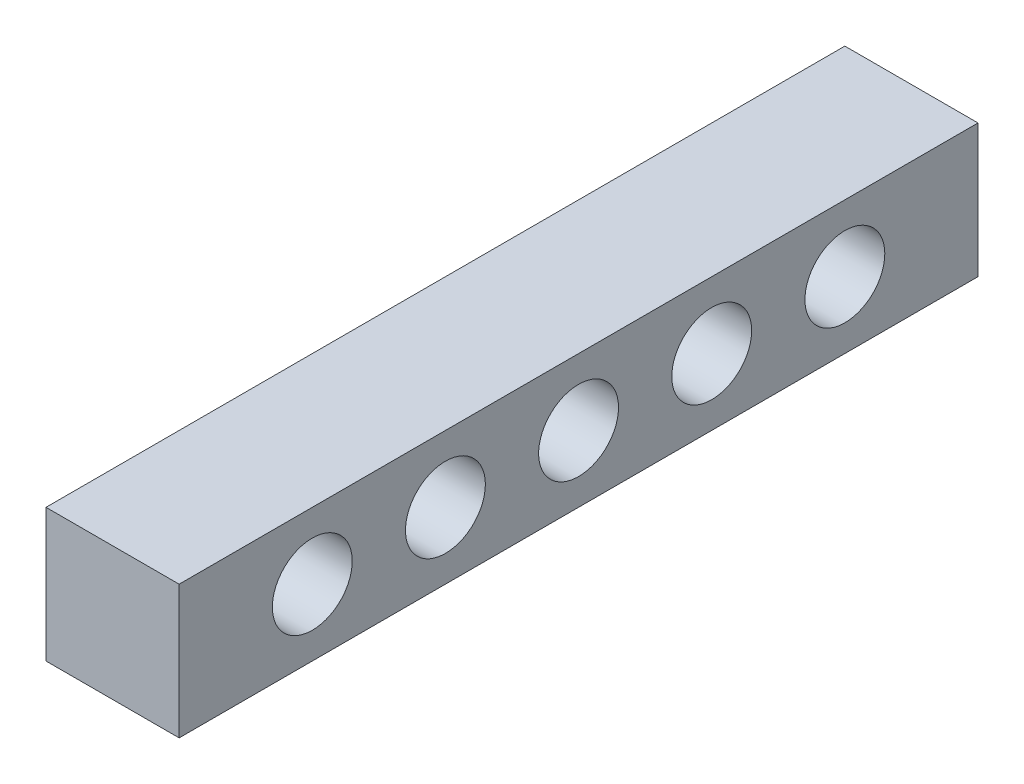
ISO-10303-21;
HEADER;
FILE_DESCRIPTION(('STEP AP214'),'2;1');
FILE_NAME('part.step','',(''),(''),'','','');
FILE_SCHEMA(('AUTOMOTIVE_DESIGN { 1 0 10303 214 1 1 1 1 }'));
ENDSEC;
DATA;
#1=APPLICATION_CONTEXT('core data for automotive mechanical design processes');
#2=APPLICATION_PROTOCOL_DEFINITION('international standard','automotive_design',2000,#1);
#3=PRODUCT_CONTEXT('',#1,'mechanical');
#4=PRODUCT('Part','Part','',(#3));
#5=PRODUCT_RELATED_PRODUCT_CATEGORY('part','',(#4));
#6=PRODUCT_DEFINITION_FORMATION('','',#4);
#7=PRODUCT_DEFINITION_CONTEXT('part definition',#1,'design');
#8=PRODUCT_DEFINITION('design','',#6,#7);
#9=PRODUCT_DEFINITION_SHAPE('','',#8);
#10=(LENGTH_UNIT() NAMED_UNIT(*) SI_UNIT(.MILLI.,.METRE.));
#11=(NAMED_UNIT(*) PLANE_ANGLE_UNIT() SI_UNIT($,.RADIAN.));
#12=(NAMED_UNIT(*) SI_UNIT($,.STERADIAN.) SOLID_ANGLE_UNIT());
#13=UNCERTAINTY_MEASURE_WITH_UNIT(LENGTH_MEASURE(1.E-05),#10,'distance_accuracy_value','');
#14=(GEOMETRIC_REPRESENTATION_CONTEXT(3) GLOBAL_UNCERTAINTY_ASSIGNED_CONTEXT((#13)) GLOBAL_UNIT_ASSIGNED_CONTEXT((#10,
#11,#12)) REPRESENTATION_CONTEXT('',''));
#15=CARTESIAN_POINT('',(0.,0.,0.));
#16=DIRECTION('',(0.,0.,1.));
#17=DIRECTION('',(1.,0.,0.));
#18=AXIS2_PLACEMENT_3D('',#15,#16,#17);
#19=CARTESIAN_POINT('',(10.,-5.,-30.));
#20=DIRECTION('',(0.,0.,1.));
#21=DIRECTION('',(1.,0.,0.));
#22=AXIS2_PLACEMENT_3D('',#19,#20,#21);
#23=PLANE('',#22);
#24=DIRECTION('',(0.,1.,0.));
#25=VECTOR('',#24,1.);
#26=CARTESIAN_POINT('',(0.,-5.,-30.));
#27=LINE('',#26,#25);
#28=CARTESIAN_POINT('',(0.,-5.,-30.));
#29=VERTEX_POINT('',#28);
#30=CARTESIAN_POINT('',(0.,5.,-30.));
#31=VERTEX_POINT('',#30);
#32=EDGE_CURVE('E111',#29,#31,#27,.T.);
#33=ORIENTED_EDGE('',*,*,#32,.T.);
#34=DIRECTION('',(-1.,0.,0.));
#35=VECTOR('',#34,1.);
#36=CARTESIAN_POINT('',(10.,5.,-30.));
#37=LINE('',#36,#35);
#38=CARTESIAN_POINT('',(10.,5.,-30.));
#39=VERTEX_POINT('',#38);
#40=EDGE_CURVE('E11',#39,#31,#37,.T.);
#41=ORIENTED_EDGE('',*,*,#40,.F.);
#42=DIRECTION('',(0.,1.,0.));
#43=VECTOR('',#42,1.);
#44=CARTESIAN_POINT('',(10.,-5.,-30.));
#45=LINE('',#44,#43);
#46=CARTESIAN_POINT('',(10.,-5.,-30.));
#47=VERTEX_POINT('',#46);
#48=EDGE_CURVE('E95',#47,#39,#45,.T.);
#49=ORIENTED_EDGE('',*,*,#48,.F.);
#50=DIRECTION('',(-1.,0.,0.));
#51=VECTOR('',#50,1.);
#52=CARTESIAN_POINT('',(10.,-5.,-30.));
#53=LINE('',#52,#51);
#54=EDGE_CURVE('E107',#47,#29,#53,.T.);
#55=ORIENTED_EDGE('',*,*,#54,.T.);
#56=EDGE_LOOP('',(#33,#41,#49,#55));
#57=FACE_BOUND('',#56,.T.);
#58=ADVANCED_FACE('F43',(#57),#23,.F.);
#59=CARTESIAN_POINT('',(10.,5.,30.));
#60=DIRECTION('',(0.,-1.,0.));
#61=DIRECTION('',(0.,0.,-1.));
#62=AXIS2_PLACEMENT_3D('',#59,#60,#61);
#63=PLANE('',#62);
#64=DIRECTION('',(0.,0.,1.));
#65=VECTOR('',#64,1.);
#66=CARTESIAN_POINT('',(0.,5.,30.));
#67=LINE('',#66,#65);
#68=CARTESIAN_POINT('',(0.,5.,30.));
#69=VERTEX_POINT('',#68);
#70=EDGE_CURVE('E100',#31,#69,#67,.T.);
#71=ORIENTED_EDGE('',*,*,#70,.T.);
#72=DIRECTION('',(-1.,0.,0.));
#73=VECTOR('',#72,1.);
#74=CARTESIAN_POINT('',(10.,5.,30.));
#75=LINE('',#74,#73);
#76=CARTESIAN_POINT('',(10.,5.,30.));
#77=VERTEX_POINT('',#76);
#78=EDGE_CURVE('E52',#77,#69,#75,.T.);
#79=ORIENTED_EDGE('',*,*,#78,.F.);
#80=DIRECTION('',(0.,0.,1.));
#81=VECTOR('',#80,1.);
#82=CARTESIAN_POINT('',(10.,5.,30.));
#83=LINE('',#82,#81);
#84=EDGE_CURVE('E90',#39,#77,#83,.T.);
#85=ORIENTED_EDGE('',*,*,#84,.F.);
#86=ORIENTED_EDGE('',*,*,#40,.T.);
#87=EDGE_LOOP('',(#71,#79,#85,#86));
#88=FACE_BOUND('',#87,.T.);
#89=ADVANCED_FACE('F99',(#88),#63,.F.);
#90=CARTESIAN_POINT('',(10.,-5.,30.));
#91=DIRECTION('',(0.,0.,-1.));
#92=DIRECTION('',(-1.,0.,0.));
#93=AXIS2_PLACEMENT_3D('',#90,#91,#92);
#94=PLANE('',#93);
#95=DIRECTION('',(0.,-1.,0.));
#96=VECTOR('',#95,1.);
#97=CARTESIAN_POINT('',(0.,-5.,30.));
#98=LINE('',#97,#96);
#99=CARTESIAN_POINT('',(0.,-5.,30.));
#100=VERTEX_POINT('',#99);
#101=EDGE_CURVE('E77',#69,#100,#98,.T.);
#102=ORIENTED_EDGE('',*,*,#101,.T.);
#103=DIRECTION('',(-1.,0.,0.));
#104=VECTOR('',#103,1.);
#105=CARTESIAN_POINT('',(10.,-5.,30.));
#106=LINE('',#105,#104);
#107=CARTESIAN_POINT('',(10.,-5.,30.));
#108=VERTEX_POINT('',#107);
#109=EDGE_CURVE('E102',#108,#100,#106,.T.);
#110=ORIENTED_EDGE('',*,*,#109,.F.);
#111=DIRECTION('',(0.,-1.,0.));
#112=VECTOR('',#111,1.);
#113=CARTESIAN_POINT('',(10.,-5.,30.));
#114=LINE('',#113,#112);
#115=EDGE_CURVE('E93',#77,#108,#114,.T.);
#116=ORIENTED_EDGE('',*,*,#115,.F.);
#117=ORIENTED_EDGE('',*,*,#78,.T.);
#118=EDGE_LOOP('',(#102,#110,#116,#117));
#119=FACE_BOUND('',#118,.T.);
#120=ADVANCED_FACE('F103',(#119),#94,.F.);
#121=CARTESIAN_POINT('',(10.,-5.,30.));
#122=DIRECTION('',(0.,1.,0.));
#123=DIRECTION('',(0.,0.,1.));
#124=AXIS2_PLACEMENT_3D('',#121,#122,#123);
#125=PLANE('',#124);
#126=DIRECTION('',(0.,0.,-1.));
#127=VECTOR('',#126,1.);
#128=CARTESIAN_POINT('',(0.,-5.,30.));
#129=LINE('',#128,#127);
#130=EDGE_CURVE('E83',#100,#29,#129,.T.);
#131=ORIENTED_EDGE('',*,*,#130,.T.);
#132=ORIENTED_EDGE('',*,*,#54,.F.);
#133=DIRECTION('',(0.,0.,-1.));
#134=VECTOR('',#133,1.);
#135=CARTESIAN_POINT('',(10.,-5.,30.));
#136=LINE('',#135,#134);
#137=EDGE_CURVE('E60',#108,#47,#136,.T.);
#138=ORIENTED_EDGE('',*,*,#137,.F.);
#139=ORIENTED_EDGE('',*,*,#109,.T.);
#140=EDGE_LOOP('',(#131,#132,#138,#139));
#141=FACE_BOUND('',#140,.T.);
#142=ADVANCED_FACE('F125',(#141),#125,.F.);
#143=CARTESIAN_POINT('',(10.,0.,0.));
#144=DIRECTION('',(-1.,0.,0.));
#145=DIRECTION('',(0.,0.,1.));
#146=AXIS2_PLACEMENT_3D('',#143,#144,#145);
#147=PLANE('',#146);
#148=CARTESIAN_POINT('',(10.,0.,-20.));
#149=DIRECTION('',(1.,0.,0.));
#150=DIRECTION('',(0.,0.,-1.));
#151=AXIS2_PLACEMENT_3D('',#148,#149,#150);
#152=CIRCLE('',#151,3.);
#153=CARTESIAN_POINT('',(10.,0.,-23.));
#154=VERTEX_POINT('',#153);
#155=EDGE_CURVE('E164',#154,#154,#152,.T.);
#156=ORIENTED_EDGE('',*,*,#155,.F.);
#157=EDGE_LOOP('',(#156));
#158=FACE_BOUND('',#157,.T.);
#159=CARTESIAN_POINT('',(10.,0.,-10.));
#160=DIRECTION('',(1.,0.,0.));
#161=DIRECTION('',(0.,0.,-1.));
#162=AXIS2_PLACEMENT_3D('',#159,#160,#161);
#163=CIRCLE('',#162,3.);
#164=CARTESIAN_POINT('',(10.,0.,-13.));
#165=VERTEX_POINT('',#164);
#166=EDGE_CURVE('E160',#165,#165,#163,.T.);
#167=ORIENTED_EDGE('',*,*,#166,.F.);
#168=EDGE_LOOP('',(#167));
#169=FACE_BOUND('',#168,.T.);
#170=CARTESIAN_POINT('',(10.,0.,0.));
#171=DIRECTION('',(1.,0.,0.));
#172=DIRECTION('',(0.,0.,-1.));
#173=AXIS2_PLACEMENT_3D('',#170,#171,#172);
#174=CIRCLE('',#173,3.);
#175=CARTESIAN_POINT('',(10.,0.,-3.));
#176=VERTEX_POINT('',#175);
#177=EDGE_CURVE('E152',#176,#176,#174,.T.);
#178=ORIENTED_EDGE('',*,*,#177,.F.);
#179=EDGE_LOOP('',(#178));
#180=FACE_BOUND('',#179,.T.);
#181=CARTESIAN_POINT('',(10.,0.,10.));
#182=DIRECTION('',(1.,0.,0.));
#183=DIRECTION('',(0.,0.,-1.));
#184=AXIS2_PLACEMENT_3D('',#181,#182,#183);
#185=CIRCLE('',#184,3.);
#186=CARTESIAN_POINT('',(10.,0.,7.));
#187=VERTEX_POINT('',#186);
#188=EDGE_CURVE('E144',#187,#187,#185,.T.);
#189=ORIENTED_EDGE('',*,*,#188,.F.);
#190=EDGE_LOOP('',(#189));
#191=FACE_BOUND('',#190,.T.);
#192=CARTESIAN_POINT('',(10.,0.,20.));
#193=DIRECTION('',(1.,0.,0.));
#194=DIRECTION('',(0.,0.,-1.));
#195=AXIS2_PLACEMENT_3D('',#192,#193,#194);
#196=CIRCLE('',#195,3.);
#197=CARTESIAN_POINT('',(10.,0.,17.));
#198=VERTEX_POINT('',#197);
#199=EDGE_CURVE('E136',#198,#198,#196,.T.);
#200=ORIENTED_EDGE('',*,*,#199,.F.);
#201=EDGE_LOOP('',(#200));
#202=FACE_BOUND('',#201,.T.);
#203=ORIENTED_EDGE('',*,*,#48,.T.);
#204=ORIENTED_EDGE('',*,*,#84,.T.);
#205=ORIENTED_EDGE('',*,*,#115,.T.);
#206=ORIENTED_EDGE('',*,*,#137,.T.);
#207=EDGE_LOOP('',(#203,#204,#205,#206));
#208=FACE_BOUND('',#207,.T.);
#209=ADVANCED_FACE('F91',(#158,#169,#180,#191,#202,#208),#147,.F.);
#210=CARTESIAN_POINT('',(0.,0.,0.));
#211=DIRECTION('',(-1.,0.,0.));
#212=DIRECTION('',(0.,0.,1.));
#213=AXIS2_PLACEMENT_3D('',#210,#211,#212);
#214=PLANE('',#213);
#215=CARTESIAN_POINT('',(0.,0.,-20.));
#216=DIRECTION('',(1.,0.,0.));
#217=DIRECTION('',(0.,0.,-1.));
#218=AXIS2_PLACEMENT_3D('',#215,#216,#217);
#219=CIRCLE('',#218,3.);
#220=CARTESIAN_POINT('',(0.,0.,-23.));
#221=VERTEX_POINT('',#220);
#222=EDGE_CURVE('E115',#221,#221,#219,.T.);
#223=ORIENTED_EDGE('',*,*,#222,.T.);
#224=EDGE_LOOP('',(#223));
#225=FACE_BOUND('',#224,.T.);
#226=CARTESIAN_POINT('',(0.,0.,-10.));
#227=DIRECTION('',(1.,0.,0.));
#228=DIRECTION('',(0.,0.,-1.));
#229=AXIS2_PLACEMENT_3D('',#226,#227,#228);
#230=CIRCLE('',#229,3.);
#231=CARTESIAN_POINT('',(0.,0.,-13.));
#232=VERTEX_POINT('',#231);
#233=EDGE_CURVE('E156',#232,#232,#230,.T.);
#234=ORIENTED_EDGE('',*,*,#233,.T.);
#235=EDGE_LOOP('',(#234));
#236=FACE_BOUND('',#235,.T.);
#237=CARTESIAN_POINT('',(0.,0.,0.));
#238=DIRECTION('',(1.,0.,0.));
#239=DIRECTION('',(0.,0.,-1.));
#240=AXIS2_PLACEMENT_3D('',#237,#238,#239);
#241=CIRCLE('',#240,3.);
#242=CARTESIAN_POINT('',(0.,0.,-3.));
#243=VERTEX_POINT('',#242);
#244=EDGE_CURVE('E148',#243,#243,#241,.T.);
#245=ORIENTED_EDGE('',*,*,#244,.T.);
#246=EDGE_LOOP('',(#245));
#247=FACE_BOUND('',#246,.T.);
#248=CARTESIAN_POINT('',(0.,0.,10.));
#249=DIRECTION('',(1.,0.,0.));
#250=DIRECTION('',(0.,0.,-1.));
#251=AXIS2_PLACEMENT_3D('',#248,#249,#250);
#252=CIRCLE('',#251,3.);
#253=CARTESIAN_POINT('',(0.,0.,7.));
#254=VERTEX_POINT('',#253);
#255=EDGE_CURVE('E140',#254,#254,#252,.T.);
#256=ORIENTED_EDGE('',*,*,#255,.T.);
#257=EDGE_LOOP('',(#256));
#258=FACE_BOUND('',#257,.T.);
#259=CARTESIAN_POINT('',(0.,0.,20.));
#260=DIRECTION('',(1.,0.,0.));
#261=DIRECTION('',(0.,0.,-1.));
#262=AXIS2_PLACEMENT_3D('',#259,#260,#261);
#263=CIRCLE('',#262,3.);
#264=CARTESIAN_POINT('',(0.,0.,17.));
#265=VERTEX_POINT('',#264);
#266=EDGE_CURVE('E132',#265,#265,#263,.T.);
#267=ORIENTED_EDGE('',*,*,#266,.T.);
#268=EDGE_LOOP('',(#267));
#269=FACE_BOUND('',#268,.T.);
#270=ORIENTED_EDGE('',*,*,#32,.F.);
#271=ORIENTED_EDGE('',*,*,#130,.F.);
#272=ORIENTED_EDGE('',*,*,#101,.F.);
#273=ORIENTED_EDGE('',*,*,#70,.F.);
#274=EDGE_LOOP('',(#270,#271,#272,#273));
#275=FACE_BOUND('',#274,.T.);
#276=ADVANCED_FACE('F128',(#225,#236,#247,#258,#269,#275),#214,.T.);
#277=CARTESIAN_POINT('',(0.,0.,20.));
#278=DIRECTION('',(1.,0.,0.));
#279=DIRECTION('',(0.,0.,-1.));
#280=AXIS2_PLACEMENT_3D('',#277,#278,#279);
#281=CYLINDRICAL_SURFACE('',#280,3.);
#282=ORIENTED_EDGE('',*,*,#266,.F.);
#283=EDGE_LOOP('',(#282));
#284=FACE_BOUND('',#283,.T.);
#285=ORIENTED_EDGE('',*,*,#199,.T.);
#286=EDGE_LOOP('',(#285));
#287=FACE_BOUND('',#286,.T.);
#288=ADVANCED_FACE('F192',(#284,#287),#281,.F.);
#289=CARTESIAN_POINT('',(0.,0.,10.));
#290=DIRECTION('',(1.,0.,0.));
#291=DIRECTION('',(0.,0.,-1.));
#292=AXIS2_PLACEMENT_3D('',#289,#290,#291);
#293=CYLINDRICAL_SURFACE('',#292,3.);
#294=ORIENTED_EDGE('',*,*,#255,.F.);
#295=EDGE_LOOP('',(#294));
#296=FACE_BOUND('',#295,.T.);
#297=ORIENTED_EDGE('',*,*,#188,.T.);
#298=EDGE_LOOP('',(#297));
#299=FACE_BOUND('',#298,.T.);
#300=ADVANCED_FACE('F194',(#296,#299),#293,.F.);
#301=CARTESIAN_POINT('',(0.,0.,0.));
#302=DIRECTION('',(1.,0.,0.));
#303=DIRECTION('',(0.,0.,-1.));
#304=AXIS2_PLACEMENT_3D('',#301,#302,#303);
#305=CYLINDRICAL_SURFACE('',#304,3.);
#306=ORIENTED_EDGE('',*,*,#244,.F.);
#307=EDGE_LOOP('',(#306));
#308=FACE_BOUND('',#307,.T.);
#309=ORIENTED_EDGE('',*,*,#177,.T.);
#310=EDGE_LOOP('',(#309));
#311=FACE_BOUND('',#310,.T.);
#312=ADVANCED_FACE('F201',(#308,#311),#305,.F.);
#313=CARTESIAN_POINT('',(0.,0.,-10.));
#314=DIRECTION('',(1.,0.,0.));
#315=DIRECTION('',(0.,0.,-1.));
#316=AXIS2_PLACEMENT_3D('',#313,#314,#315);
#317=CYLINDRICAL_SURFACE('',#316,3.);
#318=ORIENTED_EDGE('',*,*,#233,.F.);
#319=EDGE_LOOP('',(#318));
#320=FACE_BOUND('',#319,.T.);
#321=ORIENTED_EDGE('',*,*,#166,.T.);
#322=EDGE_LOOP('',(#321));
#323=FACE_BOUND('',#322,.T.);
#324=ADVANCED_FACE('F177',(#320,#323),#317,.F.);
#325=CARTESIAN_POINT('',(0.,0.,-20.));
#326=DIRECTION('',(1.,0.,0.));
#327=DIRECTION('',(0.,0.,-1.));
#328=AXIS2_PLACEMENT_3D('',#325,#326,#327);
#329=CYLINDRICAL_SURFACE('',#328,3.);
#330=ORIENTED_EDGE('',*,*,#222,.F.);
#331=EDGE_LOOP('',(#330));
#332=FACE_BOUND('',#331,.T.);
#333=ORIENTED_EDGE('',*,*,#155,.T.);
#334=EDGE_LOOP('',(#333));
#335=FACE_BOUND('',#334,.T.);
#336=ADVANCED_FACE('F174',(#332,#335),#329,.F.);
#337=CLOSED_SHELL('',(#58,#89,#120,#142,#209,#276,#288,#300,#312,#324,#336));
#338=MANIFOLD_SOLID_BREP('B2',#337);
#339=ADVANCED_BREP_SHAPE_REPRESENTATION('',(#18,#338),#14);
#340=SHAPE_DEFINITION_REPRESENTATION(#9,#339);
ENDSEC;
END-ISO-10303-21;
